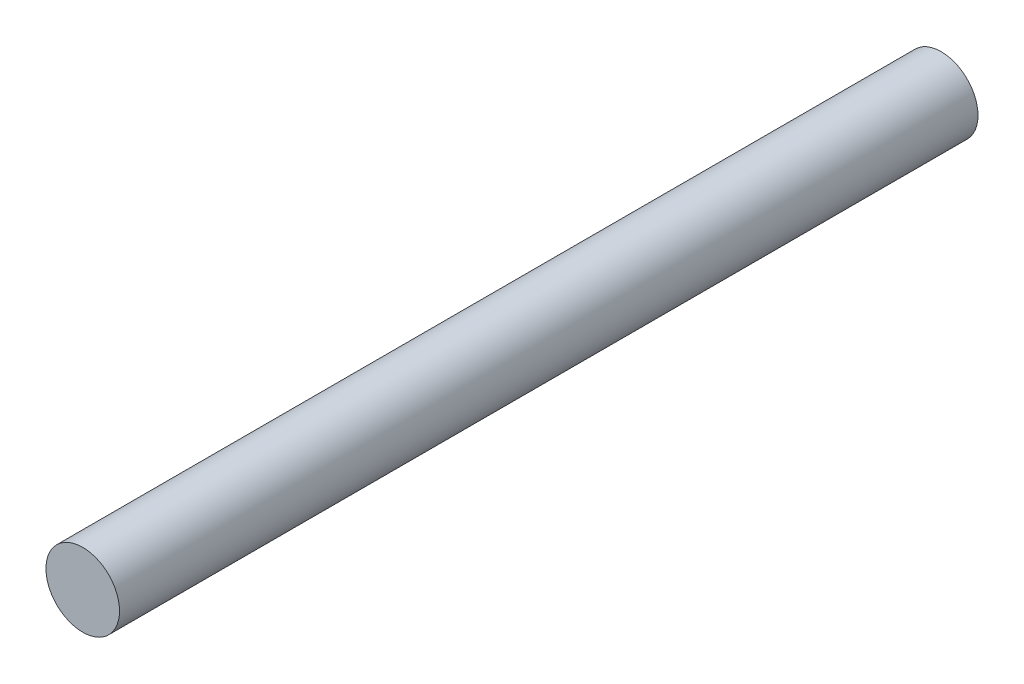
ISO-10303-21;
HEADER;
FILE_DESCRIPTION(('STEP AP214'),'2;1');
FILE_NAME('part.step','',(''),(''),'','','');
FILE_SCHEMA(('AUTOMOTIVE_DESIGN { 1 0 10303 214 1 1 1 1 }'));
ENDSEC;
DATA;
#1=APPLICATION_CONTEXT('core data for automotive mechanical design processes');
#2=APPLICATION_PROTOCOL_DEFINITION('international standard','automotive_design',2000,#1);
#3=PRODUCT_CONTEXT('',#1,'mechanical');
#4=PRODUCT('Part','Part','',(#3));
#5=PRODUCT_RELATED_PRODUCT_CATEGORY('part','',(#4));
#6=PRODUCT_DEFINITION_FORMATION('','',#4);
#7=PRODUCT_DEFINITION_CONTEXT('part definition',#1,'design');
#8=PRODUCT_DEFINITION('design','',#6,#7);
#9=PRODUCT_DEFINITION_SHAPE('','',#8);
#10=(LENGTH_UNIT() NAMED_UNIT(*) SI_UNIT(.MILLI.,.METRE.));
#11=(NAMED_UNIT(*) PLANE_ANGLE_UNIT() SI_UNIT($,.RADIAN.));
#12=(NAMED_UNIT(*) SI_UNIT($,.STERADIAN.) SOLID_ANGLE_UNIT());
#13=UNCERTAINTY_MEASURE_WITH_UNIT(LENGTH_MEASURE(1.E-05),#10,'distance_accuracy_value','');
#14=(GEOMETRIC_REPRESENTATION_CONTEXT(3) GLOBAL_UNCERTAINTY_ASSIGNED_CONTEXT((#13)) GLOBAL_UNIT_ASSIGNED_CONTEXT((#10,
#11,#12)) REPRESENTATION_CONTEXT('',''));
#15=CARTESIAN_POINT('',(0.,0.,0.));
#16=DIRECTION('',(0.,0.,1.));
#17=DIRECTION('',(1.,0.,0.));
#18=AXIS2_PLACEMENT_3D('',#15,#16,#17);
#19=CARTESIAN_POINT('',(0.,0.,-700.));
#20=DIRECTION('',(0.,0.,1.));
#21=DIRECTION('',(1.,0.,0.));
#22=AXIS2_PLACEMENT_3D('',#19,#20,#21);
#23=CYLINDRICAL_SURFACE('',#22,30.);
#24=CARTESIAN_POINT('',(0.,0.,-700.));
#25=DIRECTION('',(0.,0.,1.));
#26=DIRECTION('',(1.,0.,0.));
#27=AXIS2_PLACEMENT_3D('',#24,#25,#26);
#28=CIRCLE('',#27,30.);
#29=CARTESIAN_POINT('',(30.,0.,-700.));
#30=VERTEX_POINT('',#29);
#31=EDGE_CURVE('E10',#30,#30,#28,.T.);
#32=ORIENTED_EDGE('',*,*,#31,.T.);
#33=EDGE_LOOP('',(#32));
#34=FACE_BOUND('',#33,.T.);
#35=CARTESIAN_POINT('',(0.,0.,0.));
#36=DIRECTION('',(0.,0.,1.));
#37=DIRECTION('',(1.,0.,0.));
#38=AXIS2_PLACEMENT_3D('',#35,#36,#37);
#39=CIRCLE('',#38,30.);
#40=CARTESIAN_POINT('',(30.,0.,0.));
#41=VERTEX_POINT('',#40);
#42=EDGE_CURVE('E40',#41,#41,#39,.T.);
#43=ORIENTED_EDGE('',*,*,#42,.F.);
#44=EDGE_LOOP('',(#43));
#45=FACE_BOUND('',#44,.T.);
#46=ADVANCED_FACE('F37',(#34,#45),#23,.T.);
#47=CARTESIAN_POINT('',(0.,0.,-700.));
#48=DIRECTION('',(0.,0.,1.));
#49=DIRECTION('',(1.,0.,0.));
#50=AXIS2_PLACEMENT_3D('',#47,#48,#49);
#51=PLANE('',#50);
#52=ORIENTED_EDGE('',*,*,#31,.F.);
#53=EDGE_LOOP('',(#52));
#54=FACE_BOUND('',#53,.T.);
#55=ADVANCED_FACE('F54',(#54),#51,.F.);
#56=CARTESIAN_POINT('',(0.,0.,0.));
#57=DIRECTION('',(0.,0.,1.));
#58=DIRECTION('',(1.,0.,0.));
#59=AXIS2_PLACEMENT_3D('',#56,#57,#58);
#60=PLANE('',#59);
#61=ORIENTED_EDGE('',*,*,#42,.T.);
#62=EDGE_LOOP('',(#61));
#63=FACE_BOUND('',#62,.T.);
#64=ADVANCED_FACE('F51',(#63),#60,.T.);
#65=CLOSED_SHELL('',(#46,#55,#64));
#66=MANIFOLD_SOLID_BREP('B2',#65);
#67=ADVANCED_BREP_SHAPE_REPRESENTATION('',(#18,#66),#14);
#68=SHAPE_DEFINITION_REPRESENTATION(#9,#67);
ENDSEC;
END-ISO-10303-21;
